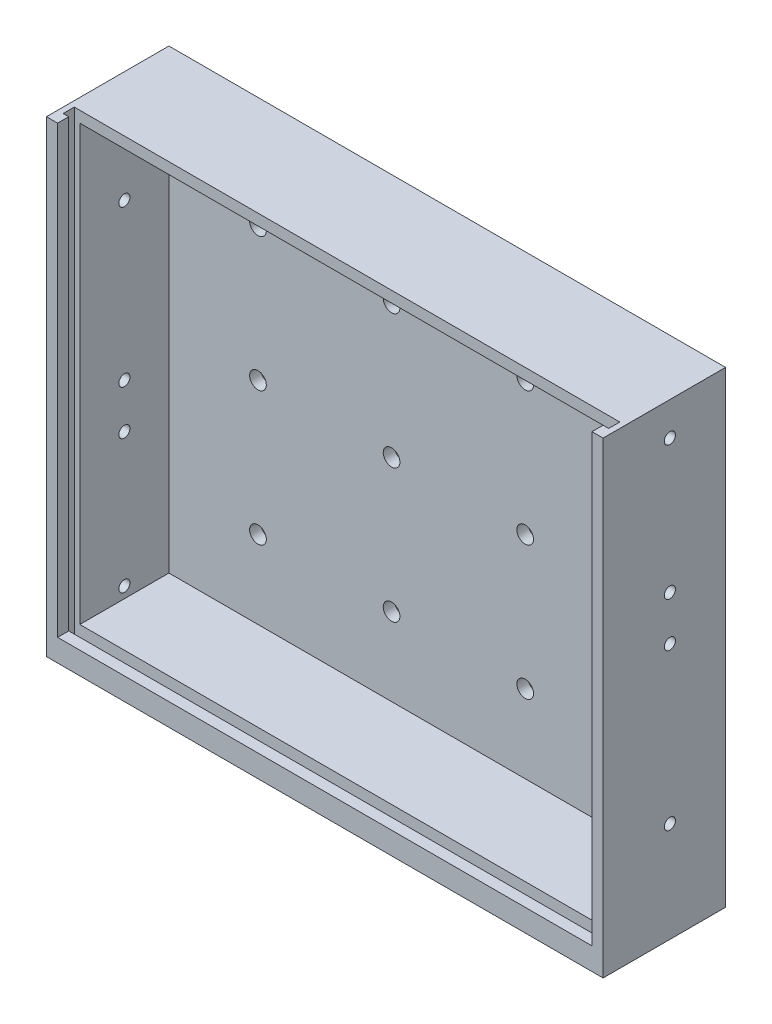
from build123d import *

# Parameters (mm, degrees)
SKETCH1_W                 = 317.5
SKETCH1_H                 = 266.7
BOSS_EXTRUDE2_DEPTH       = 6.35
BOSS_EXTRUDE5_DEPTH       = 63.5
SKETCH6_W                 = 311.15
SKETCH6_H                 = 6.35
CUT_EXTRUDE2_DEPTH        = 314.325
SKETCH7_W                 = 304.8
SKETCH7_H                 = 6.35
BOSS_EXTRUDE6_DEPTH       = 50.8
SKETCH8_R                 = 4.7625
CUT_EXTRUDE3_DEPTH        = 6.35
SKETCH9_R                 = 3.175
CUT_EXTRUDE4_DEPTH        = 6.35
SKETCH10_R                = 3.175
CUT_EXTRUDE5_DEPTH        = 6.35
LPATTERN3_COUNT           = 2
LPATTERN3_PITCH           = 76.2
LPATTERN4_COUNT           = 2
LPATTERN4_PITCH           = 76.2
LPATTERN4_COPY_1_SKETCH_R = 4.7625
LPATTERN4_COPY_1_DEPTH    = 6.35


with BuildPart() as part:
    # Sketch1 → Boss-Extrude2 (new body)
    with BuildSketch(Plane.XY):
        with Locations((158.75, -133.35)):
            Rectangle(SKETCH1_W, SKETCH1_H)
    extrude(amount=BOSS_EXTRUDE2_DEPTH)

    # Sketch4 → Boss-Extrude5 (add)
    with BuildSketch(Plane.XY.offset(6.35)):
        Polygon((6.35, -254), (6.35, 0), (0, 0), (0, -266.7), (317.5, -266.7), (317.5, 0), (311.15, 0), (311.15, -254), align=None)
    extrude(amount=BOSS_EXTRUDE5_DEPTH)

    # Sketch6 → Cut-Extrude2 (cut)
    with BuildSketch(Plane(origin=(0, 0, 0), x_dir=(1, 0, 0), z_dir=(0, 1, 0))):
        with Locations((158.75, -60.325)):
            Rectangle(SKETCH6_W, SKETCH6_H)
    extrude(amount=-CUT_EXTRUDE2_DEPTH, mode=Mode.SUBTRACT)

    # Sketch7 → Boss-Extrude6 (add)
    with BuildSketch(Plane.XY.offset(6.35)):
        with Locations((158.75, -3.175)):
            Rectangle(SKETCH7_W, SKETCH7_H)
    extrude(amount=BOSS_EXTRUDE6_DEPTH)

    # Sketch8 → Cut-Extrude3 (cut)
    with BuildSketch(Plane.XY.offset(6.35)):
        with Locations((57.15, -57.15)):
            Circle(SKETCH8_R)
        with Locations((209.55, -57.15)):
            Circle(SKETCH8_R)
        with Locations((57.15, -209.55)):
            Circle(SKETCH8_R)
        with Locations((209.55, -209.55)):
            Circle(SKETCH8_R)
    cut_extrude3 = extrude(amount=-CUT_EXTRUDE3_DEPTH, mode=Mode.SUBTRACT)

    # Sketch9 → Cut-Extrude4 (cut)
    with BuildSketch(Plane.ZY):
        with Locations(Location((31.75, -57.15, 0), (0, 0, 270))):
            Circle(SKETCH9_R)
        with Locations(Location((31.75, -146.05, 0), (0, 0, 270))):
            Circle(SKETCH9_R)
        with Locations(Location((31.75, -171.45, 0), (0, 0, 270))):
            Circle(SKETCH9_R)
        with Locations(Location((31.75, -247.65, 0), (0, 0, 270))):
            Circle(SKETCH9_R)
        with Locations((31.75, -273.05)):
            Circle(SKETCH9_R)
    extrude(amount=-CUT_EXTRUDE4_DEPTH, mode=Mode.SUBTRACT)

    # Sketch10 → Cut-Extrude5 (cut)
    with BuildSketch(Plane(origin=(317.5, 0, 0), x_dir=(0, 0, -1), z_dir=(1, 0, 0))):
        with Locations(Location((-31.75, -209.55, 0), (0, 0, 90))):
            Circle(SKETCH10_R)
        with Locations(Location((-31.75, -120.65, 0), (0, 0, 90))):
            Circle(SKETCH10_R)
        with Locations(Location((-31.75, -95.25, 0), (0, 0, 90))):
            Circle(SKETCH10_R)
        with Locations(Location((-31.75, -19.05, 0), (0, 0, 90))):
            Circle(SKETCH10_R)
        with Locations((-31.75, 6.35)):
            Circle(SKETCH10_R)
    extrude(amount=-CUT_EXTRUDE5_DEPTH, mode=Mode.SUBTRACT)

    # LPattern3: Cut-Extrude3 ×2
    with Locations(*[(0, -i * LPATTERN3_PITCH, 0) for i in range(1, LPATTERN3_COUNT)]):
        add(cut_extrude3, mode=Mode.SUBTRACT)

    # LPattern4: Cut-Extrude3 ×2
    with Locations(*[(i * LPATTERN4_PITCH, 0, 0) for i in range(1, LPATTERN4_COUNT)]):
        add(cut_extrude3, mode=Mode.SUBTRACT)

    # LPattern4 copy 1 sketch → LPattern4 copy 1 (cut)
    with BuildSketch(Plane(origin=(76.2, -76.2, 6.35), x_dir=(1, 0, 0), z_dir=(0, 0, 1))):
        with Locations((57.15, -57.15)):
            Circle(LPATTERN4_COPY_1_SKETCH_R)
        with Locations((209.55, -57.15)):
            Circle(LPATTERN4_COPY_1_SKETCH_R)
        with Locations((57.15, -209.55)):
            Circle(LPATTERN4_COPY_1_SKETCH_R)
        with Locations((209.55, -209.55)):
            Circle(LPATTERN4_COPY_1_SKETCH_R)
    extrude(amount=-LPATTERN4_COPY_1_DEPTH, mode=Mode.SUBTRACT)


solid = part.part
